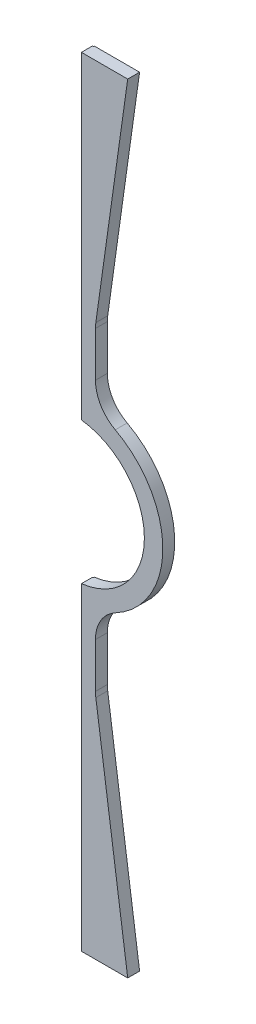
ISO-10303-21;
HEADER;
FILE_DESCRIPTION(('STEP AP214'),'2;1');
FILE_NAME('part.step','',(''),(''),'','','');
FILE_SCHEMA(('AUTOMOTIVE_DESIGN { 1 0 10303 214 1 1 1 1 }'));
ENDSEC;
DATA;
#1=APPLICATION_CONTEXT('core data for automotive mechanical design processes');
#2=APPLICATION_PROTOCOL_DEFINITION('international standard','automotive_design',2000,#1);
#3=PRODUCT_CONTEXT('',#1,'mechanical');
#4=PRODUCT('Part','Part','',(#3));
#5=PRODUCT_RELATED_PRODUCT_CATEGORY('part','',(#4));
#6=PRODUCT_DEFINITION_FORMATION('','',#4);
#7=PRODUCT_DEFINITION_CONTEXT('part definition',#1,'design');
#8=PRODUCT_DEFINITION('design','',#6,#7);
#9=PRODUCT_DEFINITION_SHAPE('','',#8);
#10=(LENGTH_UNIT() NAMED_UNIT(*) SI_UNIT(.MILLI.,.METRE.));
#11=(NAMED_UNIT(*) PLANE_ANGLE_UNIT() SI_UNIT($,.RADIAN.));
#12=(NAMED_UNIT(*) SI_UNIT($,.STERADIAN.) SOLID_ANGLE_UNIT());
#13=UNCERTAINTY_MEASURE_WITH_UNIT(LENGTH_MEASURE(1.E-05),#10,'distance_accuracy_value','');
#14=(GEOMETRIC_REPRESENTATION_CONTEXT(3) GLOBAL_UNCERTAINTY_ASSIGNED_CONTEXT((#13)) GLOBAL_UNIT_ASSIGNED_CONTEXT((#10,
#11,#12)) REPRESENTATION_CONTEXT('',''));
#15=CARTESIAN_POINT('',(0.,0.,0.));
#16=DIRECTION('',(0.,0.,1.));
#17=DIRECTION('',(1.,0.,0.));
#18=AXIS2_PLACEMENT_3D('',#15,#16,#17);
#19=CARTESIAN_POINT('',(32.,83.9859004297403,3.175));
#20=DIRECTION('',(0.,0.,-1.));
#21=DIRECTION('',(-1.,0.,0.));
#22=AXIS2_PLACEMENT_3D('',#19,#20,#21);
#23=CYLINDRICAL_SURFACE('',#22,20.);
#24=CARTESIAN_POINT('',(32.,83.9859004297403,-3.175));
#25=DIRECTION('',(0.,0.,-1.));
#26=DIRECTION('',(1.,0.,0.));
#27=AXIS2_PLACEMENT_3D('',#24,#25,#26);
#28=CIRCLE('',#27,20.);
#29=CARTESIAN_POINT('',(12.,83.9859004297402,-3.175));
#30=VERTEX_POINT('',#29);
#31=CARTESIAN_POINT('',(12.1946386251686,86.7693624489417,-3.175));
#32=VERTEX_POINT('',#31);
#33=EDGE_CURVE('E200',#30,#32,#28,.T.);
#34=ORIENTED_EDGE('',*,*,#33,.T.);
#35=DIRECTION('',(0.,0.,-1.));
#36=VECTOR('',#35,1.);
#37=CARTESIAN_POINT('',(12.1946386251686,86.7693624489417,3.175));
#38=LINE('',#37,#36);
#39=CARTESIAN_POINT('',(12.1946386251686,86.7693624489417,3.175));
#40=VERTEX_POINT('',#39);
#41=EDGE_CURVE('E37',#40,#32,#38,.T.);
#42=ORIENTED_EDGE('',*,*,#41,.F.);
#43=CARTESIAN_POINT('',(32.,83.9859004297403,3.175));
#44=DIRECTION('',(0.,0.,-1.));
#45=DIRECTION('',(1.,0.,0.));
#46=AXIS2_PLACEMENT_3D('',#43,#44,#45);
#47=CIRCLE('',#46,20.);
#48=CARTESIAN_POINT('',(12.,83.9859004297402,3.175));
#49=VERTEX_POINT('',#48);
#50=EDGE_CURVE('E235',#49,#40,#47,.T.);
#51=ORIENTED_EDGE('',*,*,#50,.F.);
#52=DIRECTION('',(0.,0.,-1.));
#53=VECTOR('',#52,1.);
#54=CARTESIAN_POINT('',(12.,83.9859004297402,3.175));
#55=LINE('',#54,#53);
#56=EDGE_CURVE('E202',#49,#30,#55,.T.);
#57=ORIENTED_EDGE('',*,*,#56,.T.);
#58=EDGE_LOOP('',(#34,#42,#51,#57));
#59=FACE_BOUND('',#58,.T.);
#60=ADVANCED_FACE('F30',(#59),#23,.F.);
#61=CARTESIAN_POINT('',(29.2324936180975,208.,3.175));
#62=DIRECTION('',(-0.99026806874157,0.139173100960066,0.));
#63=DIRECTION('',(-0.139173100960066,-0.99026806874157,0.));
#64=AXIS2_PLACEMENT_3D('',#61,#62,#63);
#65=PLANE('',#64);
#66=DIRECTION('',(0.139173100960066,0.99026806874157,0.));
#67=VECTOR('',#66,1.);
#68=CARTESIAN_POINT('',(29.2324936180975,208.,-3.175));
#69=LINE('',#68,#67);
#70=CARTESIAN_POINT('',(29.2324936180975,208.,-3.175));
#71=VERTEX_POINT('',#70);
#72=EDGE_CURVE('E193',#32,#71,#69,.T.);
#73=ORIENTED_EDGE('',*,*,#72,.T.);
#74=DIRECTION('',(0.,0.,-1.));
#75=VECTOR('',#74,1.);
#76=CARTESIAN_POINT('',(29.2324936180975,208.,3.175));
#77=LINE('',#76,#75);
#78=CARTESIAN_POINT('',(29.2324936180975,208.,3.175));
#79=VERTEX_POINT('',#78);
#80=EDGE_CURVE('E179',#79,#71,#77,.T.);
#81=ORIENTED_EDGE('',*,*,#80,.F.);
#82=DIRECTION('',(0.139173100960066,0.99026806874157,0.));
#83=VECTOR('',#82,1.);
#84=CARTESIAN_POINT('',(29.2324936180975,208.,3.175));
#85=LINE('',#84,#83);
#86=EDGE_CURVE('E194',#40,#79,#85,.T.);
#87=ORIENTED_EDGE('',*,*,#86,.F.);
#88=ORIENTED_EDGE('',*,*,#41,.T.);
#89=EDGE_LOOP('',(#73,#81,#87,#88));
#90=FACE_BOUND('',#89,.T.);
#91=ADVANCED_FACE('F191',(#90),#65,.F.);
#92=CARTESIAN_POINT('',(29.2324936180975,208.,3.175));
#93=DIRECTION('',(0.,-1.,0.));
#94=DIRECTION('',(0.,0.,-1.));
#95=AXIS2_PLACEMENT_3D('',#92,#93,#94);
#96=PLANE('',#95);
#97=DIRECTION('',(-1.,0.,0.));
#98=VECTOR('',#97,1.);
#99=CARTESIAN_POINT('',(29.2324936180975,208.,-3.175));
#100=LINE('',#99,#98);
#101=CARTESIAN_POINT('',(4.99999999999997,208.,-3.175));
#102=VERTEX_POINT('',#101);
#103=EDGE_CURVE('E207',#71,#102,#100,.T.);
#104=ORIENTED_EDGE('',*,*,#103,.T.);
#105=DIRECTION('',(0.,0.,-1.));
#106=VECTOR('',#105,1.);
#107=CARTESIAN_POINT('',(4.99999999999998,208.,-2.675));
#108=LINE('',#107,#106);
#109=CARTESIAN_POINT('',(4.99999999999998,208.,-2.675));
#110=VERTEX_POINT('',#109);
#111=EDGE_CURVE('E44',#110,#102,#108,.T.);
#112=ORIENTED_EDGE('',*,*,#111,.F.);
#113=DIRECTION('',(1.,0.,0.));
#114=VECTOR('',#113,1.);
#115=CARTESIAN_POINT('',(4.49999999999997,208.,-2.675));
#116=LINE('',#115,#114);
#117=CARTESIAN_POINT('',(4.49999999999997,208.,-2.675));
#118=VERTEX_POINT('',#117);
#119=EDGE_CURVE('E158',#118,#110,#116,.T.);
#120=ORIENTED_EDGE('',*,*,#119,.F.);
#121=DIRECTION('',(0.,0.,-1.));
#122=VECTOR('',#121,1.);
#123=CARTESIAN_POINT('',(4.49999999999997,208.,3.175));
#124=LINE('',#123,#122);
#125=CARTESIAN_POINT('',(4.49999999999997,208.,3.175));
#126=VERTEX_POINT('',#125);
#127=EDGE_CURVE('E173',#126,#118,#124,.T.);
#128=ORIENTED_EDGE('',*,*,#127,.F.);
#129=DIRECTION('',(-1.,0.,0.));
#130=VECTOR('',#129,1.);
#131=CARTESIAN_POINT('',(29.2324936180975,208.,3.175));
#132=LINE('',#131,#130);
#133=EDGE_CURVE('E293',#79,#126,#132,.T.);
#134=ORIENTED_EDGE('',*,*,#133,.F.);
#135=ORIENTED_EDGE('',*,*,#80,.T.);
#136=EDGE_LOOP('',(#104,#112,#120,#128,#134,#135));
#137=FACE_BOUND('',#136,.T.);
#138=ADVANCED_FACE('F171',(#137),#96,.F.);
#139=CARTESIAN_POINT('',(4.49999999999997,208.,3.175));
#140=DIRECTION('',(1.,0.,0.));
#141=DIRECTION('',(0.,1.,0.));
#142=AXIS2_PLACEMENT_3D('',#139,#140,#141);
#143=PLANE('',#142);
#144=ORIENTED_EDGE('',*,*,#127,.T.);
#145=DIRECTION('',(0.,1.,0.));
#146=VECTOR('',#145,1.);
#147=CARTESIAN_POINT('',(4.49999999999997,208.,-2.675));
#148=LINE('',#147,#146);
#149=CARTESIAN_POINT('',(4.49999999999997,37.8736723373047,-2.675));
#150=VERTEX_POINT('',#149);
#151=EDGE_CURVE('E154',#150,#118,#148,.T.);
#152=ORIENTED_EDGE('',*,*,#151,.F.);
#153=DIRECTION('',(0.,0.,-1.));
#154=VECTOR('',#153,1.);
#155=CARTESIAN_POINT('',(4.49999999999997,37.8736723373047,3.175));
#156=LINE('',#155,#154);
#157=CARTESIAN_POINT('',(4.49999999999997,37.8736723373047,3.175));
#158=VERTEX_POINT('',#157);
#159=EDGE_CURVE('E180',#158,#150,#156,.T.);
#160=ORIENTED_EDGE('',*,*,#159,.F.);
#161=DIRECTION('',(0.,-1.,0.));
#162=VECTOR('',#161,1.);
#163=CARTESIAN_POINT('',(4.49999999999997,208.,3.175));
#164=LINE('',#163,#162);
#165=EDGE_CURVE('E178',#126,#158,#164,.T.);
#166=ORIENTED_EDGE('',*,*,#165,.F.);
#167=EDGE_LOOP('',(#144,#152,#160,#166));
#168=FACE_BOUND('',#167,.T.);
#169=ADVANCED_FACE('F177',(#168),#143,.F.);
#170=CARTESIAN_POINT('',(0.,0.,3.175));
#171=DIRECTION('',(0.,0.,-1.));
#172=DIRECTION('',(-1.,0.,0.));
#173=AXIS2_PLACEMENT_3D('',#170,#171,#172);
#174=CYLINDRICAL_SURFACE('',#173,38.14007153);
#175=CARTESIAN_POINT('',(0.,0.,-3.175));
#176=DIRECTION('',(0.,0.,-1.));
#177=DIRECTION('',(1.,0.,0.));
#178=AXIS2_PLACEMENT_3D('',#175,#176,#177);
#179=CIRCLE('',#178,38.14007153);
#180=CARTESIAN_POINT('',(4.99999999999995,37.8109118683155,-3.175));
#181=VERTEX_POINT('',#180);
#182=CARTESIAN_POINT('',(4.99999999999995,-37.8109118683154,-3.175));
#183=VERTEX_POINT('',#182);
#184=EDGE_CURVE('E216',#181,#183,#179,.T.);
#185=ORIENTED_EDGE('',*,*,#184,.T.);
#186=DIRECTION('',(0.,0.,-1.));
#187=VECTOR('',#186,1.);
#188=CARTESIAN_POINT('',(4.99999999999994,-37.8109118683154,3.175));
#189=LINE('',#188,#187);
#190=CARTESIAN_POINT('',(4.99999999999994,-37.8109118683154,-2.675));
#191=VERTEX_POINT('',#190);
#192=EDGE_CURVE('E52',#183,#191,#189,.F.);
#193=ORIENTED_EDGE('',*,*,#192,.T.);
#194=CARTESIAN_POINT('',(0.,0.,-2.675));
#195=DIRECTION('',(0.,0.,1.));
#196=DIRECTION('',(1.,0.,0.));
#197=AXIS2_PLACEMENT_3D('',#194,#195,#196);
#198=CIRCLE('',#197,38.14007153);
#199=CARTESIAN_POINT('',(4.49999999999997,-37.8736723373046,-2.675));
#200=VERTEX_POINT('',#199);
#201=EDGE_CURVE('E205',#191,#200,#198,.F.);
#202=ORIENTED_EDGE('',*,*,#201,.T.);
#203=DIRECTION('',(0.,0.,-1.));
#204=VECTOR('',#203,1.);
#205=CARTESIAN_POINT('',(4.49999999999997,-37.8736723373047,3.175));
#206=LINE('',#205,#204);
#207=CARTESIAN_POINT('',(4.49999999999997,-37.8736723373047,3.175));
#208=VERTEX_POINT('',#207);
#209=EDGE_CURVE('E184',#208,#200,#206,.T.);
#210=ORIENTED_EDGE('',*,*,#209,.F.);
#211=CARTESIAN_POINT('',(0.,0.,3.175));
#212=DIRECTION('',(0.,0.,-1.));
#213=DIRECTION('',(1.,0.,0.));
#214=AXIS2_PLACEMENT_3D('',#211,#212,#213);
#215=CIRCLE('',#214,38.14007153);
#216=EDGE_CURVE('E271',#158,#208,#215,.T.);
#217=ORIENTED_EDGE('',*,*,#216,.F.);
#218=ORIENTED_EDGE('',*,*,#159,.T.);
#219=CARTESIAN_POINT('',(4.99999999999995,37.8109118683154,-2.675));
#220=VERTEX_POINT('',#219);
#221=EDGE_CURVE('E160',#150,#220,#198,.F.);
#222=ORIENTED_EDGE('',*,*,#221,.T.);
#223=DIRECTION('',(0.,0.,-1.));
#224=VECTOR('',#223,1.);
#225=CARTESIAN_POINT('',(4.99999999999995,37.8109118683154,3.175));
#226=LINE('',#225,#224);
#227=EDGE_CURVE('E286',#220,#181,#226,.T.);
#228=ORIENTED_EDGE('',*,*,#227,.T.);
#229=EDGE_LOOP('',(#185,#193,#202,#210,#217,#218,#222,#228));
#230=FACE_BOUND('',#229,.T.);
#231=ADVANCED_FACE('F270',(#230),#174,.F.);
#232=CARTESIAN_POINT('',(4.50000000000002,-208.,3.175));
#233=DIRECTION('',(1.,0.,0.));
#234=DIRECTION('',(0.,1.,0.));
#235=AXIS2_PLACEMENT_3D('',#232,#233,#234);
#236=PLANE('',#235);
#237=ORIENTED_EDGE('',*,*,#209,.T.);
#238=CARTESIAN_POINT('',(4.49999999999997,-208.,-2.675));
#239=VERTEX_POINT('',#238);
#240=EDGE_CURVE('E165',#239,#200,#148,.T.);
#241=ORIENTED_EDGE('',*,*,#240,.F.);
#242=DIRECTION('',(0.,0.,-1.));
#243=VECTOR('',#242,1.);
#244=CARTESIAN_POINT('',(4.50000000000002,-208.,3.175));
#245=LINE('',#244,#243);
#246=CARTESIAN_POINT('',(4.50000000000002,-208.,3.175));
#247=VERTEX_POINT('',#246);
#248=EDGE_CURVE('E258',#247,#239,#245,.T.);
#249=ORIENTED_EDGE('',*,*,#248,.F.);
#250=DIRECTION('',(0.,-1.,0.));
#251=VECTOR('',#250,1.);
#252=CARTESIAN_POINT('',(4.50000000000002,-208.,3.175));
#253=LINE('',#252,#251);
#254=EDGE_CURVE('E267',#208,#247,#253,.T.);
#255=ORIENTED_EDGE('',*,*,#254,.F.);
#256=EDGE_LOOP('',(#237,#241,#249,#255));
#257=FACE_BOUND('',#256,.T.);
#258=ADVANCED_FACE('F265',(#257),#236,.F.);
#259=CARTESIAN_POINT('',(29.2324936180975,-208.,3.175));
#260=DIRECTION('',(0.,1.,0.));
#261=DIRECTION('',(0.,0.,1.));
#262=AXIS2_PLACEMENT_3D('',#259,#260,#261);
#263=PLANE('',#262);
#264=DIRECTION('',(-1.,0.,0.));
#265=VECTOR('',#264,1.);
#266=CARTESIAN_POINT('',(4.49999999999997,-208.,-2.675));
#267=LINE('',#266,#265);
#268=CARTESIAN_POINT('',(4.99999999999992,-208.,-2.675));
#269=VERTEX_POINT('',#268);
#270=EDGE_CURVE('E281',#269,#239,#267,.T.);
#271=ORIENTED_EDGE('',*,*,#270,.F.);
#272=DIRECTION('',(0.,0.,-1.));
#273=VECTOR('',#272,1.);
#274=CARTESIAN_POINT('',(4.99999999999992,-208.,-2.675));
#275=LINE('',#274,#273);
#276=CARTESIAN_POINT('',(4.99999999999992,-208.,-3.175));
#277=VERTEX_POINT('',#276);
#278=EDGE_CURVE('E277',#269,#277,#275,.T.);
#279=ORIENTED_EDGE('',*,*,#278,.T.);
#280=DIRECTION('',(1.,0.,0.));
#281=VECTOR('',#280,1.);
#282=CARTESIAN_POINT('',(29.2324936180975,-208.,-3.175));
#283=LINE('',#282,#281);
#284=CARTESIAN_POINT('',(29.2324936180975,-208.,-3.175));
#285=VERTEX_POINT('',#284);
#286=EDGE_CURVE('E219',#277,#285,#283,.T.);
#287=ORIENTED_EDGE('',*,*,#286,.T.);
#288=DIRECTION('',(0.,0.,-1.));
#289=VECTOR('',#288,1.);
#290=CARTESIAN_POINT('',(29.2324936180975,-208.,3.175));
#291=LINE('',#290,#289);
#292=CARTESIAN_POINT('',(29.2324936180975,-208.,3.175));
#293=VERTEX_POINT('',#292);
#294=EDGE_CURVE('E255',#293,#285,#291,.T.);
#295=ORIENTED_EDGE('',*,*,#294,.F.);
#296=DIRECTION('',(1.,0.,0.));
#297=VECTOR('',#296,1.);
#298=CARTESIAN_POINT('',(29.2324936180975,-208.,3.175));
#299=LINE('',#298,#297);
#300=EDGE_CURVE('E298',#247,#293,#299,.T.);
#301=ORIENTED_EDGE('',*,*,#300,.F.);
#302=ORIENTED_EDGE('',*,*,#248,.T.);
#303=EDGE_LOOP('',(#271,#279,#287,#295,#301,#302));
#304=FACE_BOUND('',#303,.T.);
#305=ADVANCED_FACE('F350',(#304),#263,.F.);
#306=CARTESIAN_POINT('',(29.2324936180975,-208.,3.175));
#307=DIRECTION('',(-0.99026806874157,-0.139173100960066,0.));
#308=DIRECTION('',(0.139173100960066,-0.99026806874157,0.));
#309=AXIS2_PLACEMENT_3D('',#306,#307,#308);
#310=PLANE('',#309);
#311=DIRECTION('',(-0.139173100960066,0.99026806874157,0.));
#312=VECTOR('',#311,1.);
#313=CARTESIAN_POINT('',(29.2324936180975,-208.,-3.175));
#314=LINE('',#313,#312);
#315=CARTESIAN_POINT('',(12.1946386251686,-86.7693624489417,-3.175));
#316=VERTEX_POINT('',#315);
#317=EDGE_CURVE('E221',#285,#316,#314,.T.);
#318=ORIENTED_EDGE('',*,*,#317,.T.);
#319=DIRECTION('',(0.,0.,-1.));
#320=VECTOR('',#319,1.);
#321=CARTESIAN_POINT('',(12.1946386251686,-86.7693624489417,3.175));
#322=LINE('',#321,#320);
#323=CARTESIAN_POINT('',(12.1946386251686,-86.7693624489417,3.175));
#324=VERTEX_POINT('',#323);
#325=EDGE_CURVE('E252',#324,#316,#322,.T.);
#326=ORIENTED_EDGE('',*,*,#325,.F.);
#327=DIRECTION('',(-0.139173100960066,0.99026806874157,0.));
#328=VECTOR('',#327,1.);
#329=CARTESIAN_POINT('',(29.2324936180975,-208.,3.175));
#330=LINE('',#329,#328);
#331=EDGE_CURVE('E300',#293,#324,#330,.T.);
#332=ORIENTED_EDGE('',*,*,#331,.F.);
#333=ORIENTED_EDGE('',*,*,#294,.T.);
#334=EDGE_LOOP('',(#318,#326,#332,#333));
#335=FACE_BOUND('',#334,.T.);
#336=ADVANCED_FACE('F346',(#335),#310,.F.);
#337=CARTESIAN_POINT('',(32.,-83.9859004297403,3.175));
#338=DIRECTION('',(0.,0.,-1.));
#339=DIRECTION('',(-1.,0.,0.));
#340=AXIS2_PLACEMENT_3D('',#337,#338,#339);
#341=CYLINDRICAL_SURFACE('',#340,20.);
#342=CARTESIAN_POINT('',(32.,-83.9859004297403,-3.175));
#343=DIRECTION('',(0.,0.,-1.));
#344=DIRECTION('',(-1.,0.,0.));
#345=AXIS2_PLACEMENT_3D('',#342,#343,#344);
#346=CIRCLE('',#345,20.);
#347=CARTESIAN_POINT('',(12.,-83.9859004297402,-3.175));
#348=VERTEX_POINT('',#347);
#349=EDGE_CURVE('E223',#316,#348,#346,.T.);
#350=ORIENTED_EDGE('',*,*,#349,.T.);
#351=DIRECTION('',(0.,0.,-1.));
#352=VECTOR('',#351,1.);
#353=CARTESIAN_POINT('',(12.,-83.9859004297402,3.175));
#354=LINE('',#353,#352);
#355=CARTESIAN_POINT('',(12.,-83.9859004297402,3.175));
#356=VERTEX_POINT('',#355);
#357=EDGE_CURVE('E249',#356,#348,#354,.T.);
#358=ORIENTED_EDGE('',*,*,#357,.F.);
#359=CARTESIAN_POINT('',(32.,-83.9859004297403,3.175));
#360=DIRECTION('',(0.,0.,-1.));
#361=DIRECTION('',(-1.,0.,0.));
#362=AXIS2_PLACEMENT_3D('',#359,#360,#361);
#363=CIRCLE('',#362,20.);
#364=EDGE_CURVE('E302',#324,#356,#363,.T.);
#365=ORIENTED_EDGE('',*,*,#364,.F.);
#366=ORIENTED_EDGE('',*,*,#325,.T.);
#367=EDGE_LOOP('',(#350,#358,#365,#366));
#368=FACE_BOUND('',#367,.T.);
#369=ADVANCED_FACE('F342',(#368),#341,.F.);
#370=CARTESIAN_POINT('',(12.,-83.9859004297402,3.175));
#371=DIRECTION('',(-1.,0.,0.));
#372=DIRECTION('',(0.,-1.,0.));
#373=AXIS2_PLACEMENT_3D('',#370,#371,#372);
#374=PLANE('',#373);
#375=DIRECTION('',(0.,1.,0.));
#376=VECTOR('',#375,1.);
#377=CARTESIAN_POINT('',(12.,-83.9859004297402,-3.175));
#378=LINE('',#377,#376);
#379=CARTESIAN_POINT('',(12.,-60.,-3.175));
#380=VERTEX_POINT('',#379);
#381=EDGE_CURVE('E225',#348,#380,#378,.T.);
#382=ORIENTED_EDGE('',*,*,#381,.T.);
#383=DIRECTION('',(0.,0.,-1.));
#384=VECTOR('',#383,1.);
#385=CARTESIAN_POINT('',(12.,-60.,3.175));
#386=LINE('',#385,#384);
#387=CARTESIAN_POINT('',(12.,-60.,3.175));
#388=VERTEX_POINT('',#387);
#389=EDGE_CURVE('E246',#388,#380,#386,.T.);
#390=ORIENTED_EDGE('',*,*,#389,.F.);
#391=DIRECTION('',(0.,1.,0.));
#392=VECTOR('',#391,1.);
#393=CARTESIAN_POINT('',(12.,-83.9859004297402,3.175));
#394=LINE('',#393,#392);
#395=EDGE_CURVE('E304',#356,#388,#394,.T.);
#396=ORIENTED_EDGE('',*,*,#395,.F.);
#397=ORIENTED_EDGE('',*,*,#357,.T.);
#398=EDGE_LOOP('',(#382,#390,#396,#397));
#399=FACE_BOUND('',#398,.T.);
#400=ADVANCED_FACE('F337',(#399),#374,.F.);
#401=CARTESIAN_POINT('',(32.,-60.,3.175));
#402=DIRECTION('',(0.,0.,-1.));
#403=DIRECTION('',(-1.,0.,0.));
#404=AXIS2_PLACEMENT_3D('',#401,#402,#403);
#405=CYLINDRICAL_SURFACE('',#404,20.);
#406=CARTESIAN_POINT('',(32.,-60.,-3.175));
#407=DIRECTION('',(0.,0.,-1.));
#408=DIRECTION('',(1.,0.,0.));
#409=AXIS2_PLACEMENT_3D('',#406,#407,#408);
#410=CIRCLE('',#409,20.);
#411=CARTESIAN_POINT('',(22.5882352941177,-42.3529411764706,-3.175));
#412=VERTEX_POINT('',#411);
#413=EDGE_CURVE('E227',#380,#412,#410,.T.);
#414=ORIENTED_EDGE('',*,*,#413,.T.);
#415=DIRECTION('',(0.,0.,-1.));
#416=VECTOR('',#415,1.);
#417=CARTESIAN_POINT('',(22.5882352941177,-42.3529411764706,3.175));
#418=LINE('',#417,#416);
#419=CARTESIAN_POINT('',(22.5882352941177,-42.3529411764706,3.175));
#420=VERTEX_POINT('',#419);
#421=EDGE_CURVE('E243',#420,#412,#418,.T.);
#422=ORIENTED_EDGE('',*,*,#421,.F.);
#423=CARTESIAN_POINT('',(32.,-60.,3.175));
#424=DIRECTION('',(0.,0.,-1.));
#425=DIRECTION('',(1.,0.,0.));
#426=AXIS2_PLACEMENT_3D('',#423,#424,#425);
#427=CIRCLE('',#426,20.);
#428=EDGE_CURVE('E306',#388,#420,#427,.T.);
#429=ORIENTED_EDGE('',*,*,#428,.F.);
#430=ORIENTED_EDGE('',*,*,#389,.T.);
#431=EDGE_LOOP('',(#414,#422,#429,#430));
#432=FACE_BOUND('',#431,.T.);
#433=ADVANCED_FACE('F331',(#432),#405,.F.);
#434=CARTESIAN_POINT('',(0.,0.,3.175));
#435=DIRECTION('',(0.,0.,-1.));
#436=DIRECTION('',(-1.,0.,0.));
#437=AXIS2_PLACEMENT_3D('',#434,#435,#436);
#438=CYLINDRICAL_SURFACE('',#437,48.);
#439=CARTESIAN_POINT('',(0.,0.,-3.175));
#440=DIRECTION('',(0.,0.,1.));
#441=DIRECTION('',(1.,0.,0.));
#442=AXIS2_PLACEMENT_3D('',#439,#440,#441);
#443=CIRCLE('',#442,48.);
#444=CARTESIAN_POINT('',(22.5882352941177,42.3529411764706,-3.175));
#445=VERTEX_POINT('',#444);
#446=EDGE_CURVE('E229',#412,#445,#443,.T.);
#447=ORIENTED_EDGE('',*,*,#446,.T.);
#448=DIRECTION('',(0.,0.,-1.));
#449=VECTOR('',#448,1.);
#450=CARTESIAN_POINT('',(22.5882352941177,42.3529411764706,3.175));
#451=LINE('',#450,#449);
#452=CARTESIAN_POINT('',(22.5882352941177,42.3529411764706,3.175));
#453=VERTEX_POINT('',#452);
#454=EDGE_CURVE('E240',#453,#445,#451,.T.);
#455=ORIENTED_EDGE('',*,*,#454,.F.);
#456=CARTESIAN_POINT('',(0.,0.,3.175));
#457=DIRECTION('',(0.,0.,1.));
#458=DIRECTION('',(1.,0.,0.));
#459=AXIS2_PLACEMENT_3D('',#456,#457,#458);
#460=CIRCLE('',#459,48.);
#461=EDGE_CURVE('E308',#420,#453,#460,.T.);
#462=ORIENTED_EDGE('',*,*,#461,.F.);
#463=ORIENTED_EDGE('',*,*,#421,.T.);
#464=EDGE_LOOP('',(#447,#455,#462,#463));
#465=FACE_BOUND('',#464,.T.);
#466=ADVANCED_FACE('F327',(#465),#438,.T.);
#467=CARTESIAN_POINT('',(32.,60.,3.175));
#468=DIRECTION('',(0.,0.,-1.));
#469=DIRECTION('',(-1.,0.,0.));
#470=AXIS2_PLACEMENT_3D('',#467,#468,#469);
#471=CYLINDRICAL_SURFACE('',#470,20.);
#472=CARTESIAN_POINT('',(32.,60.,-3.175));
#473=DIRECTION('',(0.,0.,-1.));
#474=DIRECTION('',(-1.,0.,0.));
#475=AXIS2_PLACEMENT_3D('',#472,#473,#474);
#476=CIRCLE('',#475,20.);
#477=CARTESIAN_POINT('',(12.,60.,-3.175));
#478=VERTEX_POINT('',#477);
#479=EDGE_CURVE('E231',#445,#478,#476,.T.);
#480=ORIENTED_EDGE('',*,*,#479,.T.);
#481=DIRECTION('',(0.,0.,-1.));
#482=VECTOR('',#481,1.);
#483=CARTESIAN_POINT('',(12.,60.,3.175));
#484=LINE('',#483,#482);
#485=CARTESIAN_POINT('',(12.,60.,3.175));
#486=VERTEX_POINT('',#485);
#487=EDGE_CURVE('E237',#486,#478,#484,.T.);
#488=ORIENTED_EDGE('',*,*,#487,.F.);
#489=CARTESIAN_POINT('',(32.,60.,3.175));
#490=DIRECTION('',(0.,0.,-1.));
#491=DIRECTION('',(-1.,0.,0.));
#492=AXIS2_PLACEMENT_3D('',#489,#490,#491);
#493=CIRCLE('',#492,20.);
#494=EDGE_CURVE('E309',#453,#486,#493,.T.);
#495=ORIENTED_EDGE('',*,*,#494,.F.);
#496=ORIENTED_EDGE('',*,*,#454,.T.);
#497=EDGE_LOOP('',(#480,#488,#495,#496));
#498=FACE_BOUND('',#497,.T.);
#499=ADVANCED_FACE('F323',(#498),#471,.F.);
#500=CARTESIAN_POINT('',(12.,83.9859004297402,3.175));
#501=DIRECTION('',(-1.,0.,0.));
#502=DIRECTION('',(0.,-1.,0.));
#503=AXIS2_PLACEMENT_3D('',#500,#501,#502);
#504=PLANE('',#503);
#505=DIRECTION('',(0.,1.,0.));
#506=VECTOR('',#505,1.);
#507=CARTESIAN_POINT('',(12.,83.9859004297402,-3.175));
#508=LINE('',#507,#506);
#509=EDGE_CURVE('E233',#478,#30,#508,.T.);
#510=ORIENTED_EDGE('',*,*,#509,.T.);
#511=ORIENTED_EDGE('',*,*,#56,.F.);
#512=DIRECTION('',(0.,1.,0.));
#513=VECTOR('',#512,1.);
#514=CARTESIAN_POINT('',(12.,83.9859004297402,3.175));
#515=LINE('',#514,#513);
#516=EDGE_CURVE('E212',#486,#49,#515,.T.);
#517=ORIENTED_EDGE('',*,*,#516,.F.);
#518=ORIENTED_EDGE('',*,*,#487,.T.);
#519=EDGE_LOOP('',(#510,#511,#517,#518));
#520=FACE_BOUND('',#519,.T.);
#521=ADVANCED_FACE('F316',(#520),#504,.F.);
#522=CARTESIAN_POINT('',(32.,83.9859004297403,3.175));
#523=DIRECTION('',(0.,0.,1.));
#524=DIRECTION('',(1.,0.,0.));
#525=AXIS2_PLACEMENT_3D('',#522,#523,#524);
#526=PLANE('',#525);
#527=ORIENTED_EDGE('',*,*,#50,.T.);
#528=ORIENTED_EDGE('',*,*,#86,.T.);
#529=ORIENTED_EDGE('',*,*,#133,.T.);
#530=ORIENTED_EDGE('',*,*,#165,.T.);
#531=ORIENTED_EDGE('',*,*,#216,.T.);
#532=ORIENTED_EDGE('',*,*,#254,.T.);
#533=ORIENTED_EDGE('',*,*,#300,.T.);
#534=ORIENTED_EDGE('',*,*,#331,.T.);
#535=ORIENTED_EDGE('',*,*,#364,.T.);
#536=ORIENTED_EDGE('',*,*,#395,.T.);
#537=ORIENTED_EDGE('',*,*,#428,.T.);
#538=ORIENTED_EDGE('',*,*,#461,.T.);
#539=ORIENTED_EDGE('',*,*,#494,.T.);
#540=ORIENTED_EDGE('',*,*,#516,.T.);
#541=EDGE_LOOP('',(#527,#528,#529,#530,#531,#532,#533,#534,#535,#536,#537,#538,#539,#540));
#542=FACE_BOUND('',#541,.T.);
#543=ADVANCED_FACE('F314',(#542),#526,.T.);
#544=CARTESIAN_POINT('',(32.,83.9859004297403,-3.175));
#545=DIRECTION('',(0.,0.,1.));
#546=DIRECTION('',(1.,0.,0.));
#547=AXIS2_PLACEMENT_3D('',#544,#545,#546);
#548=PLANE('',#547);
#549=ORIENTED_EDGE('',*,*,#286,.F.);
#550=DIRECTION('',(0.,1.,0.));
#551=VECTOR('',#550,1.);
#552=CARTESIAN_POINT('',(4.99999999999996,83.9859004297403,-3.175));
#553=LINE('',#552,#551);
#554=EDGE_CURVE('E11',#277,#183,#553,.T.);
#555=ORIENTED_EDGE('',*,*,#554,.T.);
#556=ORIENTED_EDGE('',*,*,#184,.F.);
#557=DIRECTION('',(0.,-1.,0.));
#558=VECTOR('',#557,1.);
#559=CARTESIAN_POINT('',(4.99999999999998,208.,-3.175));
#560=LINE('',#559,#558);
#561=EDGE_CURVE('E166',#102,#181,#560,.T.);
#562=ORIENTED_EDGE('',*,*,#561,.F.);
#563=ORIENTED_EDGE('',*,*,#103,.F.);
#564=ORIENTED_EDGE('',*,*,#72,.F.);
#565=ORIENTED_EDGE('',*,*,#33,.F.);
#566=ORIENTED_EDGE('',*,*,#509,.F.);
#567=ORIENTED_EDGE('',*,*,#479,.F.);
#568=ORIENTED_EDGE('',*,*,#446,.F.);
#569=ORIENTED_EDGE('',*,*,#413,.F.);
#570=ORIENTED_EDGE('',*,*,#381,.F.);
#571=ORIENTED_EDGE('',*,*,#349,.F.);
#572=ORIENTED_EDGE('',*,*,#317,.F.);
#573=EDGE_LOOP('',(#549,#555,#556,#562,#563,#564,#565,#566,#567,#568,#569,#570,#571,#572));
#574=FACE_BOUND('',#573,.T.);
#575=ADVANCED_FACE('F319',(#574),#548,.F.);
#576=CARTESIAN_POINT('',(4.99999999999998,208.,-2.675));
#577=DIRECTION('',(1.,0.,0.));
#578=DIRECTION('',(0.,1.,0.));
#579=AXIS2_PLACEMENT_3D('',#576,#577,#578);
#580=PLANE('',#579);
#581=DIRECTION('',(0.,-1.,0.));
#582=VECTOR('',#581,1.);
#583=CARTESIAN_POINT('',(4.99999999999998,208.,-2.675));
#584=LINE('',#583,#582);
#585=EDGE_CURVE('E279',#110,#220,#584,.T.);
#586=ORIENTED_EDGE('',*,*,#585,.F.);
#587=ORIENTED_EDGE('',*,*,#111,.T.);
#588=ORIENTED_EDGE('',*,*,#561,.T.);
#589=ORIENTED_EDGE('',*,*,#227,.F.);
#590=EDGE_LOOP('',(#586,#587,#588,#589));
#591=FACE_BOUND('',#590,.T.);
#592=ADVANCED_FACE('F353',(#591),#580,.F.);
#593=CARTESIAN_POINT('',(4.49999999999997,-208.,-2.675));
#594=DIRECTION('',(0.,0.,1.));
#595=DIRECTION('',(1.,0.,0.));
#596=AXIS2_PLACEMENT_3D('',#593,#594,#595);
#597=PLANE('',#596);
#598=ORIENTED_EDGE('',*,*,#151,.T.);
#599=ORIENTED_EDGE('',*,*,#119,.T.);
#600=ORIENTED_EDGE('',*,*,#585,.T.);
#601=ORIENTED_EDGE('',*,*,#221,.F.);
#602=EDGE_LOOP('',(#598,#599,#600,#601));
#603=FACE_BOUND('',#602,.T.);
#604=ADVANCED_FACE('F156',(#603),#597,.F.);
#605=EDGE_CURVE('E175',#191,#269,#584,.T.);
#606=ORIENTED_EDGE('',*,*,#605,.T.);
#607=ORIENTED_EDGE('',*,*,#270,.T.);
#608=ORIENTED_EDGE('',*,*,#240,.T.);
#609=ORIENTED_EDGE('',*,*,#201,.F.);
#610=EDGE_LOOP('',(#606,#607,#608,#609));
#611=FACE_BOUND('',#610,.T.);
#612=ADVANCED_FACE('F273',(#611),#597,.F.);
#613=ORIENTED_EDGE('',*,*,#554,.F.);
#614=ORIENTED_EDGE('',*,*,#278,.F.);
#615=ORIENTED_EDGE('',*,*,#605,.F.);
#616=ORIENTED_EDGE('',*,*,#192,.F.);
#617=EDGE_LOOP('',(#613,#614,#615,#616));
#618=FACE_BOUND('',#617,.T.);
#619=ADVANCED_FACE('F275',(#618),#580,.F.);
#620=CLOSED_SHELL('',(#60,#91,#138,#169,#231,#258,#305,#336,#369,#400,#433,#466,#499,#521,#543,
#575,#592,#604,#612,#619));
#621=MANIFOLD_SOLID_BREP('B2',#620);
#622=ADVANCED_BREP_SHAPE_REPRESENTATION('',(#18,#621),#14);
#623=SHAPE_DEFINITION_REPRESENTATION(#9,#622);
ENDSEC;
END-ISO-10303-21;
